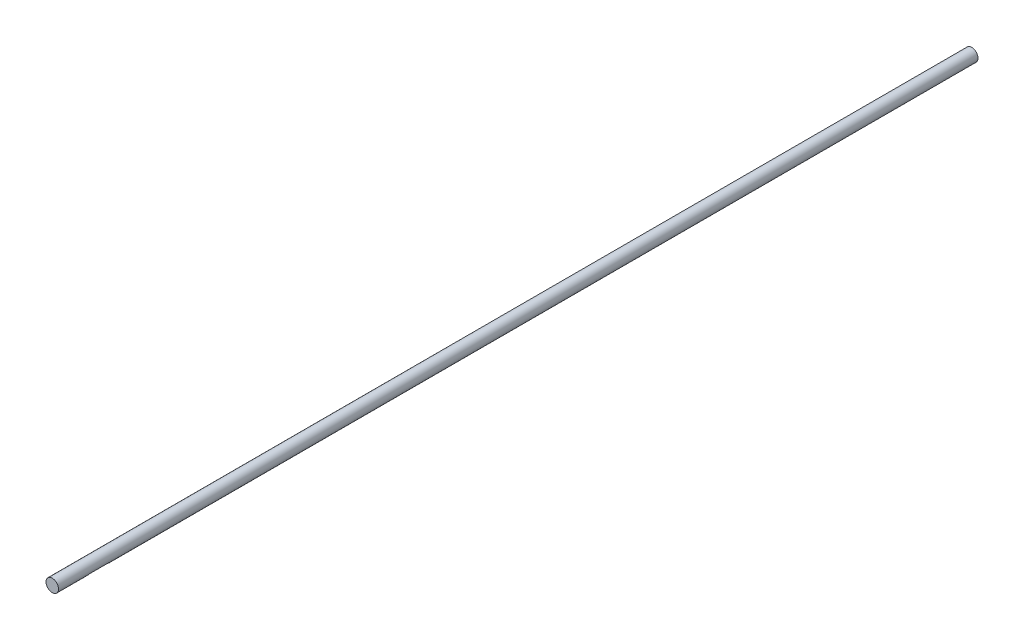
ISO-10303-21;
HEADER;
FILE_DESCRIPTION(('STEP AP214'),'2;1');
FILE_NAME('part.step','',(''),(''),'','','');
FILE_SCHEMA(('AUTOMOTIVE_DESIGN { 1 0 10303 214 1 1 1 1 }'));
ENDSEC;
DATA;
#1=APPLICATION_CONTEXT('core data for automotive mechanical design processes');
#2=APPLICATION_PROTOCOL_DEFINITION('international standard','automotive_design',2000,#1);
#3=PRODUCT_CONTEXT('',#1,'mechanical');
#4=PRODUCT('Part','Part','',(#3));
#5=PRODUCT_RELATED_PRODUCT_CATEGORY('part','',(#4));
#6=PRODUCT_DEFINITION_FORMATION('','',#4);
#7=PRODUCT_DEFINITION_CONTEXT('part definition',#1,'design');
#8=PRODUCT_DEFINITION('design','',#6,#7);
#9=PRODUCT_DEFINITION_SHAPE('','',#8);
#10=(LENGTH_UNIT() NAMED_UNIT(*) SI_UNIT(.MILLI.,.METRE.));
#11=(NAMED_UNIT(*) PLANE_ANGLE_UNIT() SI_UNIT($,.RADIAN.));
#12=(NAMED_UNIT(*) SI_UNIT($,.STERADIAN.) SOLID_ANGLE_UNIT());
#13=UNCERTAINTY_MEASURE_WITH_UNIT(LENGTH_MEASURE(1.E-05),#10,'distance_accuracy_value','');
#14=(GEOMETRIC_REPRESENTATION_CONTEXT(3) GLOBAL_UNCERTAINTY_ASSIGNED_CONTEXT((#13)) GLOBAL_UNIT_ASSIGNED_CONTEXT((#10,
#11,#12)) REPRESENTATION_CONTEXT('',''));
#15=CARTESIAN_POINT('',(0.,0.,0.));
#16=DIRECTION('',(0.,0.,1.));
#17=DIRECTION('',(1.,0.,0.));
#18=AXIS2_PLACEMENT_3D('',#15,#16,#17);
#19=CARTESIAN_POINT('',(0.,0.,88.));
#20=DIRECTION('',(0.,0.,-1.));
#21=DIRECTION('',(-1.,0.,0.));
#22=AXIS2_PLACEMENT_3D('',#19,#20,#21);
#23=CYLINDRICAL_SURFACE('',#22,0.6);
#24=CARTESIAN_POINT('',(0.,0.,85.));
#25=DIRECTION('',(0.,0.,1.));
#26=DIRECTION('',(1.,0.,0.));
#27=AXIS2_PLACEMENT_3D('',#24,#25,#26);
#28=CIRCLE('',#27,0.6);
#29=CARTESIAN_POINT('',(-0.519615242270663,-0.3,85.));
#30=VERTEX_POINT('',#29);
#31=CARTESIAN_POINT('',(0.519615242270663,-0.3,85.));
#32=VERTEX_POINT('',#31);
#33=EDGE_CURVE('E58',#30,#32,#28,.T.);
#34=ORIENTED_EDGE('',*,*,#33,.T.);
#35=DIRECTION('',(0.,0.,-1.));
#36=VECTOR('',#35,1.);
#37=CARTESIAN_POINT('',(0.519615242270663,-0.3,88.));
#38=LINE('',#37,#36);
#39=CARTESIAN_POINT('',(0.519615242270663,-0.3,83.));
#40=VERTEX_POINT('',#39);
#41=EDGE_CURVE('E11',#32,#40,#38,.T.);
#42=ORIENTED_EDGE('',*,*,#41,.T.);
#43=CARTESIAN_POINT('',(0.,0.,83.));
#44=DIRECTION('',(0.,0.,-1.));
#45=DIRECTION('',(-1.,0.,0.));
#46=AXIS2_PLACEMENT_3D('',#43,#44,#45);
#47=CIRCLE('',#46,0.6);
#48=CARTESIAN_POINT('',(-0.519615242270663,-0.3,83.));
#49=VERTEX_POINT('',#48);
#50=EDGE_CURVE('E37',#40,#49,#47,.T.);
#51=ORIENTED_EDGE('',*,*,#50,.T.);
#52=DIRECTION('',(0.,0.,-1.));
#53=VECTOR('',#52,1.);
#54=CARTESIAN_POINT('',(-0.519615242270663,-0.3,88.));
#55=LINE('',#54,#53);
#56=EDGE_CURVE('E60',#49,#30,#55,.F.);
#57=ORIENTED_EDGE('',*,*,#56,.T.);
#58=EDGE_LOOP('',(#34,#42,#51,#57));
#59=FACE_BOUND('',#58,.T.);
#60=CARTESIAN_POINT('',(0.,0.,88.));
#61=DIRECTION('',(0.,0.,1.));
#62=DIRECTION('',(1.,0.,0.));
#63=AXIS2_PLACEMENT_3D('',#60,#61,#62);
#64=CIRCLE('',#63,0.6);
#65=CARTESIAN_POINT('',(0.6,0.,88.));
#66=VERTEX_POINT('',#65);
#67=EDGE_CURVE('E69',#66,#66,#64,.T.);
#68=ORIENTED_EDGE('',*,*,#67,.F.);
#69=EDGE_LOOP('',(#68));
#70=FACE_BOUND('',#69,.T.);
#71=CARTESIAN_POINT('',(0.,0.,0.));
#72=DIRECTION('',(0.,0.,1.));
#73=DIRECTION('',(1.,0.,0.));
#74=AXIS2_PLACEMENT_3D('',#71,#72,#73);
#75=CIRCLE('',#74,0.6);
#76=CARTESIAN_POINT('',(0.6,0.,0.));
#77=VERTEX_POINT('',#76);
#78=EDGE_CURVE('E66',#77,#77,#75,.T.);
#79=ORIENTED_EDGE('',*,*,#78,.T.);
#80=EDGE_LOOP('',(#79));
#81=FACE_BOUND('',#80,.T.);
#82=ADVANCED_FACE('F30',(#59,#70,#81),#23,.T.);
#83=CARTESIAN_POINT('',(0.,0.,88.));
#84=DIRECTION('',(0.,0.,1.));
#85=DIRECTION('',(1.,0.,0.));
#86=AXIS2_PLACEMENT_3D('',#83,#84,#85);
#87=PLANE('',#86);
#88=ORIENTED_EDGE('',*,*,#67,.T.);
#89=EDGE_LOOP('',(#88));
#90=FACE_BOUND('',#89,.T.);
#91=ADVANCED_FACE('F77',(#90),#87,.T.);
#92=CARTESIAN_POINT('',(0.,0.,0.));
#93=DIRECTION('',(0.,0.,1.));
#94=DIRECTION('',(1.,0.,0.));
#95=AXIS2_PLACEMENT_3D('',#92,#93,#94);
#96=PLANE('',#95);
#97=ORIENTED_EDGE('',*,*,#78,.F.);
#98=EDGE_LOOP('',(#97));
#99=FACE_BOUND('',#98,.T.);
#100=ADVANCED_FACE('F82',(#99),#96,.F.);
#101=CARTESIAN_POINT('',(-0.6,-0.6,83.));
#102=DIRECTION('',(0.,0.,-1.));
#103=DIRECTION('',(-1.,0.,0.));
#104=AXIS2_PLACEMENT_3D('',#101,#102,#103);
#105=PLANE('',#104);
#106=DIRECTION('',(1.,0.,0.));
#107=VECTOR('',#106,1.);
#108=CARTESIAN_POINT('',(-0.6,-0.3,83.));
#109=LINE('',#108,#107);
#110=EDGE_CURVE('E64',#49,#40,#109,.T.);
#111=ORIENTED_EDGE('',*,*,#110,.F.);
#112=ORIENTED_EDGE('',*,*,#50,.F.);
#113=EDGE_LOOP('',(#111,#112));
#114=FACE_BOUND('',#113,.T.);
#115=ADVANCED_FACE('F84',(#114),#105,.F.);
#116=CARTESIAN_POINT('',(-0.6,-0.6,85.));
#117=DIRECTION('',(0.,0.,1.));
#118=DIRECTION('',(1.,0.,0.));
#119=AXIS2_PLACEMENT_3D('',#116,#117,#118);
#120=PLANE('',#119);
#121=DIRECTION('',(1.,0.,0.));
#122=VECTOR('',#121,1.);
#123=CARTESIAN_POINT('',(-0.6,-0.3,85.));
#124=LINE('',#123,#122);
#125=EDGE_CURVE('E44',#30,#32,#124,.T.);
#126=ORIENTED_EDGE('',*,*,#125,.T.);
#127=ORIENTED_EDGE('',*,*,#33,.F.);
#128=EDGE_LOOP('',(#126,#127));
#129=FACE_BOUND('',#128,.T.);
#130=ADVANCED_FACE('F65',(#129),#120,.F.);
#131=CARTESIAN_POINT('',(-0.6,-0.3,83.));
#132=DIRECTION('',(0.,1.,0.));
#133=DIRECTION('',(0.,0.,1.));
#134=AXIS2_PLACEMENT_3D('',#131,#132,#133);
#135=PLANE('',#134);
#136=ORIENTED_EDGE('',*,*,#125,.F.);
#137=ORIENTED_EDGE('',*,*,#56,.F.);
#138=ORIENTED_EDGE('',*,*,#110,.T.);
#139=ORIENTED_EDGE('',*,*,#41,.F.);
#140=EDGE_LOOP('',(#136,#137,#138,#139));
#141=FACE_BOUND('',#140,.T.);
#142=ADVANCED_FACE('F63',(#141),#135,.F.);
#143=CLOSED_SHELL('',(#82,#91,#100,#115,#130,#142));
#144=MANIFOLD_SOLID_BREP('B2',#143);
#145=ADVANCED_BREP_SHAPE_REPRESENTATION('',(#18,#144),#14);
#146=SHAPE_DEFINITION_REPRESENTATION(#9,#145);
ENDSEC;
END-ISO-10303-21;
